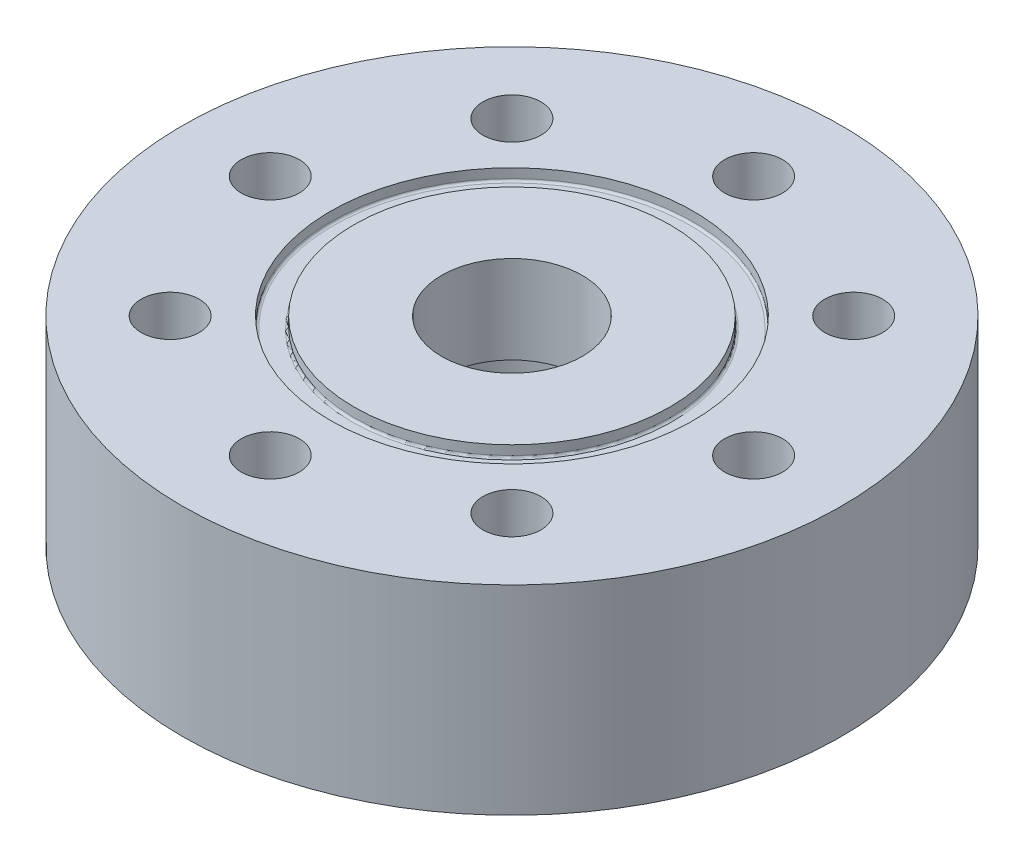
from build123d import *

# Parameters (mm, degrees)
SKETCH2_R                 = 37.5
OUTER_CYLINDER_DEPTH      = 22.7
SKETCH3_R                 = 8.93
NPT_HOLE_DEPTH            = 12.7
SKETCH4_R                 = 3.3
BOLT_HOLES_DEPTH          = 58.687000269
SKETCH5_R                 = 20.6375
SKETCH5_R_2               = 17.9705
O_RING_GROOVE_DEPTH       = 1.3208
FILLET1_R                 = 0.254
SKETCH6_R                 = 8
INLET_FLOW_DIAMETER_DEPTH = 10


with BuildPart() as part:
    # Sketch2 → Outer Cylinder (new body)
    with BuildSketch(Plane(origin=(0, 0, 0), x_dir=(1, 0, 0), z_dir=(0, 1, 0))):
        with Locations(Location((0, 0, 0), (0, 0, 270))):
            Circle(SKETCH2_R)
    extrude(amount=OUTER_CYLINDER_DEPTH)

    # Sketch3 → NPT Hole (cut)
    with BuildSketch(Plane.XZ):
        with Locations(Location((0, 0, 0), (0, 0, 270))):
            Circle(SKETCH3_R)
    extrude(amount=-NPT_HOLE_DEPTH, mode=Mode.SUBTRACT)

    # Sketch4 → Bolt Holes (cut, through all)
    with BuildSketch(Plane.XZ):
        with Locations(Location((-27.5, 0, 0), (0, 0, 270))):
            Circle(SKETCH4_R)
        with Locations(Location((-19.445436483, 19.445436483, 0), (0, 0, 270))):
            Circle(SKETCH4_R)
        with Locations(Location((0, 27.5, 0), (0, 0, 270))):
            Circle(SKETCH4_R)
        with Locations(Location((19.445436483, 19.445436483, 0), (0, 0, 270))):
            Circle(SKETCH4_R)
        with Locations(Location((27.5, 0, 0), (0, 0, 270))):
            Circle(SKETCH4_R)
        with Locations(Location((19.445436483, -19.445436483, 0), (0, 0, 270))):
            Circle(SKETCH4_R)
        with Locations(Location((0, -27.5, 0), (0, 0, 270))):
            Circle(SKETCH4_R)
        with Locations(Location((-19.445436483, -19.445436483, 0), (0, 0, 270))):
            Circle(SKETCH4_R)
    extrude(amount=-BOLT_HOLES_DEPTH, mode=Mode.SUBTRACT)

    # Sketch5 → O-Ring Groove (cut)
    with BuildSketch(Plane(origin=(0, 22.7, 0), x_dir=(1, 0, 0), z_dir=(0, 1, 0))):
        with Locations(Location((0, 0, 0), (0, 0, 270))):
            Circle(SKETCH5_R)
        with Locations(Location((0, 0, 0), (0, 0, 270))):
            Circle(SKETCH5_R_2, mode=Mode.SUBTRACT)
    extrude(amount=-O_RING_GROOVE_DEPTH, mode=Mode.SUBTRACT)

    # Fillet1
    fillet1_edges = [part.edges().sort_by_distance(p)[0] for p in [
        (0, 21.3792, -20.6375),
        (0, 21.3792, -17.9705),
    ]]
    fillet(fillet1_edges, radius=FILLET1_R)

    # Sketch6 → Inlet Flow Diameter (cut)
    with BuildSketch(Plane(origin=(0, 22.7, 0), x_dir=(1, 0, 0), z_dir=(0, 1, 0))):
        with Locations(Location((0, 0, 0), (0, 0, 270))):
            Circle(SKETCH6_R)
    extrude(amount=-INLET_FLOW_DIAMETER_DEPTH, mode=Mode.SUBTRACT)


solid = part.part
